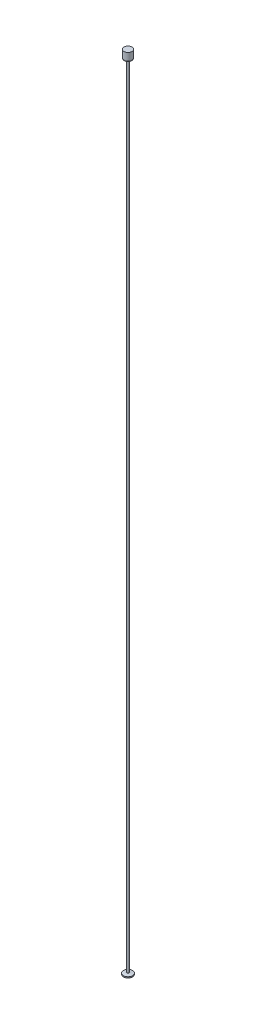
ISO-10303-21;
HEADER;
FILE_DESCRIPTION(('STEP AP214'),'2;1');
FILE_NAME('part.step','',(''),(''),'','','');
FILE_SCHEMA(('AUTOMOTIVE_DESIGN { 1 0 10303 214 1 1 1 1 }'));
ENDSEC;
DATA;
#1=APPLICATION_CONTEXT('core data for automotive mechanical design processes');
#2=APPLICATION_PROTOCOL_DEFINITION('international standard','automotive_design',2000,#1);
#3=PRODUCT_CONTEXT('',#1,'mechanical');
#4=PRODUCT('Part','Part','',(#3));
#5=PRODUCT_RELATED_PRODUCT_CATEGORY('part','',(#4));
#6=PRODUCT_DEFINITION_FORMATION('','',#4);
#7=PRODUCT_DEFINITION_CONTEXT('part definition',#1,'design');
#8=PRODUCT_DEFINITION('design','',#6,#7);
#9=PRODUCT_DEFINITION_SHAPE('','',#8);
#10=(LENGTH_UNIT() NAMED_UNIT(*) SI_UNIT(.MILLI.,.METRE.));
#11=(NAMED_UNIT(*) PLANE_ANGLE_UNIT() SI_UNIT($,.RADIAN.));
#12=(NAMED_UNIT(*) SI_UNIT($,.STERADIAN.) SOLID_ANGLE_UNIT());
#13=UNCERTAINTY_MEASURE_WITH_UNIT(LENGTH_MEASURE(1.E-05),#10,'distance_accuracy_value','');
#14=(GEOMETRIC_REPRESENTATION_CONTEXT(3) GLOBAL_UNCERTAINTY_ASSIGNED_CONTEXT((#13)) GLOBAL_UNIT_ASSIGNED_CONTEXT((#10,
#11,#12)) REPRESENTATION_CONTEXT('',''));
#15=CARTESIAN_POINT('',(0.,0.,0.));
#16=DIRECTION('',(0.,0.,1.));
#17=DIRECTION('',(1.,0.,0.));
#18=AXIS2_PLACEMENT_3D('',#15,#16,#17);
#19=CARTESIAN_POINT('',(0.,1214.5,0.));
#20=DIRECTION('',(0.,-1.,0.));
#21=DIRECTION('',(0.,0.,-1.));
#22=AXIS2_PLACEMENT_3D('',#19,#20,#21);
#23=CYLINDRICAL_SURFACE('',#22,6.);
#24=CARTESIAN_POINT('',(0.,1203.5,0.));
#25=DIRECTION('',(0.,1.,0.));
#26=DIRECTION('',(0.,0.,1.));
#27=AXIS2_PLACEMENT_3D('',#24,#25,#26);
#28=CIRCLE('',#27,6.);
#29=CARTESIAN_POINT('',(0.,1203.5,-6.));
#30=VERTEX_POINT('',#29);
#31=EDGE_CURVE('E52',#30,#30,#28,.T.);
#32=CARTESIAN_POINT('',(0.,1214.5,0.));
#33=DIRECTION('',(0.,1.,0.));
#34=DIRECTION('',(0.,0.,1.));
#35=AXIS2_PLACEMENT_3D('',#32,#33,#34);
#36=CIRCLE('',#35,6.);
#37=CARTESIAN_POINT('',(0.,1214.5,-6.));
#38=VERTEX_POINT('',#37);
#39=EDGE_CURVE('E56',#38,#38,#36,.T.);
#40=CARTESIAN_POINT('',(0.,1203.5,-6.));
#41=CARTESIAN_POINT('',(0.,1203.61458333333,-6.));
#42=CARTESIAN_POINT('',(0.,1203.72916666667,-6.));
#43=CARTESIAN_POINT('',(0.,1203.95833333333,-6.));
#44=CARTESIAN_POINT('',(0.,1204.07291666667,-6.));
#45=CARTESIAN_POINT('',(0.,1204.30208333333,-6.));
#46=CARTESIAN_POINT('',(0.,1204.41666666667,-6.));
#47=CARTESIAN_POINT('',(0.,1204.64583333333,-6.));
#48=CARTESIAN_POINT('',(0.,1204.76041666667,-6.));
#49=CARTESIAN_POINT('',(0.,1204.98958333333,-6.));
#50=CARTESIAN_POINT('',(0.,1205.10416666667,-6.));
#51=CARTESIAN_POINT('',(0.,1205.33333333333,-6.));
#52=CARTESIAN_POINT('',(0.,1205.44791666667,-6.));
#53=CARTESIAN_POINT('',(0.,1205.67708333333,-6.));
#54=CARTESIAN_POINT('',(0.,1205.79166666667,-6.));
#55=CARTESIAN_POINT('',(0.,1206.02083333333,-6.));
#56=CARTESIAN_POINT('',(0.,1206.13541666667,-6.));
#57=CARTESIAN_POINT('',(0.,1206.36458333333,-6.));
#58=CARTESIAN_POINT('',(0.,1206.47916666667,-6.));
#59=CARTESIAN_POINT('',(0.,1206.70833333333,-6.));
#60=CARTESIAN_POINT('',(0.,1206.82291666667,-6.));
#61=CARTESIAN_POINT('',(0.,1207.05208333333,-6.));
#62=CARTESIAN_POINT('',(0.,1207.16666666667,-6.));
#63=CARTESIAN_POINT('',(0.,1207.39583333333,-6.));
#64=CARTESIAN_POINT('',(0.,1207.51041666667,-6.));
#65=CARTESIAN_POINT('',(0.,1207.73958333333,-6.));
#66=CARTESIAN_POINT('',(0.,1207.85416666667,-6.));
#67=CARTESIAN_POINT('',(0.,1208.08333333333,-6.));
#68=CARTESIAN_POINT('',(0.,1208.19791666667,-6.));
#69=CARTESIAN_POINT('',(0.,1208.42708333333,-6.));
#70=CARTESIAN_POINT('',(0.,1208.54166666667,-6.));
#71=CARTESIAN_POINT('',(0.,1208.77083333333,-6.));
#72=CARTESIAN_POINT('',(0.,1208.88541666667,-6.));
#73=CARTESIAN_POINT('',(0.,1209.11458333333,-6.));
#74=CARTESIAN_POINT('',(0.,1209.22916666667,-6.));
#75=CARTESIAN_POINT('',(0.,1209.45833333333,-6.));
#76=CARTESIAN_POINT('',(0.,1209.57291666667,-6.));
#77=CARTESIAN_POINT('',(0.,1209.80208333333,-6.));
#78=CARTESIAN_POINT('',(0.,1209.91666666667,-6.));
#79=CARTESIAN_POINT('',(0.,1210.14583333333,-6.));
#80=CARTESIAN_POINT('',(0.,1210.26041666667,-6.));
#81=CARTESIAN_POINT('',(0.,1210.48958333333,-6.));
#82=CARTESIAN_POINT('',(0.,1210.60416666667,-6.));
#83=CARTESIAN_POINT('',(0.,1210.83333333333,-6.));
#84=CARTESIAN_POINT('',(0.,1210.94791666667,-6.));
#85=CARTESIAN_POINT('',(0.,1211.17708333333,-6.));
#86=CARTESIAN_POINT('',(0.,1211.29166666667,-6.));
#87=CARTESIAN_POINT('',(0.,1211.52083333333,-6.));
#88=CARTESIAN_POINT('',(0.,1211.63541666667,-6.));
#89=CARTESIAN_POINT('',(0.,1211.86458333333,-6.));
#90=CARTESIAN_POINT('',(0.,1211.97916666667,-6.));
#91=CARTESIAN_POINT('',(0.,1212.20833333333,-6.));
#92=CARTESIAN_POINT('',(0.,1212.32291666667,-6.));
#93=CARTESIAN_POINT('',(0.,1212.55208333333,-6.));
#94=CARTESIAN_POINT('',(0.,1212.66666666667,-6.));
#95=CARTESIAN_POINT('',(0.,1212.89583333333,-6.));
#96=CARTESIAN_POINT('',(0.,1213.01041666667,-6.));
#97=CARTESIAN_POINT('',(0.,1213.23958333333,-6.));
#98=CARTESIAN_POINT('',(0.,1213.35416666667,-6.));
#99=CARTESIAN_POINT('',(0.,1213.58333333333,-6.));
#100=CARTESIAN_POINT('',(0.,1213.69791666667,-6.));
#101=CARTESIAN_POINT('',(0.,1213.92708333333,-6.));
#102=CARTESIAN_POINT('',(0.,1214.04166666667,-6.));
#103=CARTESIAN_POINT('',(0.,1214.27083333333,-6.));
#104=CARTESIAN_POINT('',(0.,1214.38541666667,-6.));
#105=CARTESIAN_POINT('',(0.,1214.5,-6.));
#106=B_SPLINE_CURVE_WITH_KNOTS('',3,(#40,#41,#42,#43,#44,#45,#46,#47,#48,#49,#50,#51,#52,#53,
#54,#55,#56,#57,#58,#59,#60,#61,#62,#63,#64,#65,#66,#67,#68,#69,#70,#71,#72,#73,#74,#75,#76,#77,
#78,#79,#80,#81,#82,#83,#84,#85,#86,#87,#88,#89,#90,#91,#92,#93,#94,#95,#96,#97,#98,#99,#100,
#101,#102,#103,#104,#105),.UNSPECIFIED.,.F.,.F.,(4,2,2,2,2,2,2,2,2,2,2,2,2,2,2,2,2,2,2,2,2,2,2,
2,2,2,2,2,2,2,2,2,4),(0.,0.343750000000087,0.687500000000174,1.03125000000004,1.37500000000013,
1.71874999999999,2.06250000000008,2.40625000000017,2.75000000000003,3.09375000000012,
3.43749999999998,3.78125000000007,4.12500000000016,4.46875000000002,4.81250000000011,
5.15624999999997,5.50000000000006,5.84375000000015,6.18750000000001,6.5312500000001,
6.87499999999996,7.21875000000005,7.56250000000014,7.90625,8.25000000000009,8.59374999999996,
8.93750000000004,9.28125000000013,9.62499999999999,9.96875000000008,10.3124999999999,10.65625,
11.0000000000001),.UNSPECIFIED.);
#107=EDGE_CURVE('BSEAM45',#30,#38,#106,.T.);
#108=ORIENTED_EDGE('',*,*,#31,.T.);
#109=ORIENTED_EDGE('',*,*,#39,.F.);
#110=ORIENTED_EDGE('',*,*,#107,.T.);
#111=ORIENTED_EDGE('',*,*,#107,.F.);
#112=EDGE_LOOP('',(#108,#110,#109,#111));
#113=FACE_BOUND('',#112,.T.);
#114=ADVANCED_FACE('F45',(#113),#23,.T.);
#115=CARTESIAN_POINT('',(0.,1214.5,0.));
#116=DIRECTION('',(0.,1.,0.));
#117=DIRECTION('',(0.,0.,1.));
#118=AXIS2_PLACEMENT_3D('',#115,#116,#117);
#119=PLANE('',#118);
#120=ORIENTED_EDGE('',*,*,#39,.T.);
#121=EDGE_LOOP('',(#120));
#122=FACE_BOUND('',#121,.T.);
#123=ADVANCED_FACE('F63',(#122),#119,.T.);
#124=CARTESIAN_POINT('',(0.,1201.5,0.));
#125=DIRECTION('',(0.,1.,0.));
#126=DIRECTION('',(0.,0.,1.));
#127=AXIS2_PLACEMENT_3D('',#124,#125,#126);
#128=PLANE('',#127);
#129=CARTESIAN_POINT('',(0.,1201.5,0.));
#130=DIRECTION('',(0.,1.,0.));
#131=DIRECTION('',(0.,0.,1.));
#132=AXIS2_PLACEMENT_3D('',#129,#130,#131);
#133=CIRCLE('',#132,4.);
#134=CARTESIAN_POINT('',(0.,1201.5,4.));
#135=VERTEX_POINT('',#134);
#136=EDGE_CURVE('E11',#135,#135,#133,.F.);
#137=ORIENTED_EDGE('',*,*,#136,.T.);
#138=EDGE_LOOP('',(#137));
#139=FACE_BOUND('',#138,.T.);
#140=ADVANCED_FACE('F69',(#139),#128,.F.);
#141=CARTESIAN_POINT('',(0.,1203.5,0.));
#142=DIRECTION('',(0.,1.,0.));
#143=DIRECTION('',(0.,0.,1.));
#144=AXIS2_PLACEMENT_3D('',#141,#142,#143);
#145=TOROIDAL_SURFACE('',#144,4.,2.);
#146=ORIENTED_EDGE('',*,*,#136,.F.);
#147=EDGE_LOOP('',(#146));
#148=FACE_BOUND('',#147,.T.);
#149=ORIENTED_EDGE('',*,*,#31,.F.);
#150=EDGE_LOOP('',(#149));
#151=FACE_BOUND('',#150,.T.);
#152=ADVANCED_FACE('F47',(#148,#151),#145,.T.);
#153=CLOSED_SHELL('',(#114,#123,#140,#152));
#154=MANIFOLD_SOLID_BREP('B2',#153);
#155=CARTESIAN_POINT('',(0.,2.5,0.));
#156=DIRECTION('',(0.,-1.,0.));
#157=DIRECTION('',(0.,0.,-1.));
#158=AXIS2_PLACEMENT_3D('',#155,#156,#157);
#159=CYLINDRICAL_SURFACE('',#158,6.9);
#160=CARTESIAN_POINT('',(0.,1.61836509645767,0.));
#161=DIRECTION('',(0.,1.,0.));
#162=DIRECTION('',(0.,0.,1.));
#163=AXIS2_PLACEMENT_3D('',#160,#161,#162);
#164=CIRCLE('',#163,6.9);
#165=CARTESIAN_POINT('',(0.,1.61836509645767,-6.9));
#166=VERTEX_POINT('',#165);
#167=EDGE_CURVE('E105',#166,#166,#164,.F.);
#168=ORIENTED_EDGE('',*,*,#167,.T.);
#169=EDGE_LOOP('',(#168));
#170=FACE_BOUND('',#169,.T.);
#171=CARTESIAN_POINT('',(0.,0.,0.));
#172=DIRECTION('',(0.,1.,0.));
#173=DIRECTION('',(0.,0.,1.));
#174=AXIS2_PLACEMENT_3D('',#171,#172,#173);
#175=CIRCLE('',#174,6.9);
#176=CARTESIAN_POINT('',(0.,0.,6.9));
#177=VERTEX_POINT('',#176);
#178=EDGE_CURVE('E117',#177,#177,#175,.T.);
#179=ORIENTED_EDGE('',*,*,#178,.T.);
#180=EDGE_LOOP('',(#179));
#181=FACE_BOUND('',#180,.T.);
#182=ADVANCED_FACE('F100',(#170,#181),#159,.T.);
#183=CARTESIAN_POINT('',(0.,2.5,0.));
#184=DIRECTION('',(0.,1.,0.));
#185=DIRECTION('',(0.,0.,1.));
#186=AXIS2_PLACEMENT_3D('',#183,#184,#185);
#187=PLANE('',#186);
#188=CARTESIAN_POINT('',(0.,2.5,0.));
#189=DIRECTION('',(0.,1.,0.));
#190=DIRECTION('',(0.,0.,1.));
#191=AXIS2_PLACEMENT_3D('',#188,#189,#190);
#192=CIRCLE('',#191,1.5);
#193=CARTESIAN_POINT('',(0.,2.5,1.5));
#194=VERTEX_POINT('',#193);
#195=EDGE_CURVE('E44',#194,#194,#192,.T.);
#196=ORIENTED_EDGE('',*,*,#195,.F.);
#197=EDGE_LOOP('',(#196));
#198=FACE_BOUND('',#197,.T.);
#199=CARTESIAN_POINT('',(0.,2.5,0.));
#200=DIRECTION('',(0.,1.,0.));
#201=DIRECTION('',(0.,0.,1.));
#202=AXIS2_PLACEMENT_3D('',#199,#200,#201);
#203=CIRCLE('',#202,1.8999999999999);
#204=CARTESIAN_POINT('',(0.,2.5,-1.8999999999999));
#205=VERTEX_POINT('',#204);
#206=EDGE_CURVE('E113',#205,#205,#203,.T.);
#207=ORIENTED_EDGE('',*,*,#206,.T.);
#208=EDGE_LOOP('',(#207));
#209=FACE_BOUND('',#208,.T.);
#210=ADVANCED_FACE('F122',(#198,#209),#187,.T.);
#211=CARTESIAN_POINT('',(0.,0.,0.));
#212=DIRECTION('',(0.,1.,0.));
#213=DIRECTION('',(0.,0.,1.));
#214=AXIS2_PLACEMENT_3D('',#211,#212,#213);
#215=PLANE('',#214);
#216=ORIENTED_EDGE('',*,*,#178,.F.);
#217=EDGE_LOOP('',(#216));
#218=FACE_BOUND('',#217,.T.);
#219=ADVANCED_FACE('F126',(#218),#215,.F.);
#220=CARTESIAN_POINT('',(0.,2.5,0.));
#221=DIRECTION('',(0.,-1.,0.));
#222=DIRECTION('',(0.,0.,-1.));
#223=AXIS2_PLACEMENT_3D('',#220,#221,#222);
#224=CONICAL_SURFACE('',#223,1.8999999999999,1.39626340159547);
#225=CARTESIAN_POINT('',(0.,1.61836509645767,-6.9));
#226=CARTESIAN_POINT('',(0.,1.62754879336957,-6.84791666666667));
#227=CARTESIAN_POINT('',(0.,1.63673249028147,-6.79583333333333));
#228=CARTESIAN_POINT('',(0.,1.65509988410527,-6.69166666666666));
#229=CARTESIAN_POINT('',(0.,1.66428358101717,-6.63958333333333));
#230=CARTESIAN_POINT('',(0.,1.68265097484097,-6.53541666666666));
#231=CARTESIAN_POINT('',(0.,1.69183467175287,-6.48333333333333));
#232=CARTESIAN_POINT('',(0.,1.71020206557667,-6.37916666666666));
#233=CARTESIAN_POINT('',(0.,1.71938576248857,-6.32708333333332));
#234=CARTESIAN_POINT('',(0.,1.73775315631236,-6.22291666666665));
#235=CARTESIAN_POINT('',(0.,1.74693685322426,-6.17083333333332));
#236=CARTESIAN_POINT('',(0.,1.76530424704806,-6.06666666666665));
#237=CARTESIAN_POINT('',(0.,1.77448794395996,-6.01458333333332));
#238=CARTESIAN_POINT('',(0.,1.79285533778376,-5.91041666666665));
#239=CARTESIAN_POINT('',(0.,1.80203903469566,-5.85833333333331));
#240=CARTESIAN_POINT('',(0.,1.82040642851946,-5.75416666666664));
#241=CARTESIAN_POINT('',(0.,1.82959012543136,-5.70208333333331));
#242=CARTESIAN_POINT('',(0.,1.84795751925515,-5.59791666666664));
#243=CARTESIAN_POINT('',(0.,1.85714121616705,-5.54583333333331));
#244=CARTESIAN_POINT('',(0.,1.87550860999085,-5.44166666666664));
#245=CARTESIAN_POINT('',(0.,1.88469230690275,-5.3895833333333));
#246=CARTESIAN_POINT('',(0.,1.90305970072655,-5.28541666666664));
#247=CARTESIAN_POINT('',(0.,1.91224339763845,-5.2333333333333));
#248=CARTESIAN_POINT('',(0.,1.93061079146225,-5.12916666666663));
#249=CARTESIAN_POINT('',(0.,1.93979448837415,-5.0770833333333));
#250=CARTESIAN_POINT('',(0.,1.95816188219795,-4.97291666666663));
#251=CARTESIAN_POINT('',(0.,1.96734557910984,-4.9208333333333));
#252=CARTESIAN_POINT('',(0.,1.98571297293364,-4.81666666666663));
#253=CARTESIAN_POINT('',(0.,1.99489666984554,-4.76458333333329));
#254=CARTESIAN_POINT('',(0.,2.01326406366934,-4.66041666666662));
#255=CARTESIAN_POINT('',(0.,2.02244776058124,-4.60833333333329));
#256=CARTESIAN_POINT('',(0.,2.04081515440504,-4.50416666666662));
#257=CARTESIAN_POINT('',(0.,2.04999885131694,-4.45208333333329));
#258=CARTESIAN_POINT('',(0.,2.06836624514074,-4.34791666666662));
#259=CARTESIAN_POINT('',(0.,2.07754994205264,-4.29583333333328));
#260=CARTESIAN_POINT('',(0.,2.09591733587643,-4.19166666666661));
#261=CARTESIAN_POINT('',(0.,2.10510103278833,-4.13958333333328));
#262=CARTESIAN_POINT('',(0.,2.12346842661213,-4.03541666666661));
#263=CARTESIAN_POINT('',(0.,2.13265212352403,-3.98333333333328));
#264=CARTESIAN_POINT('',(0.,2.15101951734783,-3.87916666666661));
#265=CARTESIAN_POINT('',(0.,2.16020321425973,-3.82708333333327));
#266=CARTESIAN_POINT('',(0.,2.17857060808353,-3.72291666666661));
#267=CARTESIAN_POINT('',(0.,2.18775430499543,-3.67083333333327));
#268=CARTESIAN_POINT('',(0.,2.20612169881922,-3.5666666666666));
#269=CARTESIAN_POINT('',(0.,2.21530539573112,-3.51458333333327));
#270=CARTESIAN_POINT('',(0.,2.23367278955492,-3.4104166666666));
#271=CARTESIAN_POINT('',(0.,2.24285648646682,-3.35833333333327));
#272=CARTESIAN_POINT('',(0.,2.26122388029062,-3.2541666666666));
#273=CARTESIAN_POINT('',(0.,2.27040757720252,-3.20208333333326));
#274=CARTESIAN_POINT('',(0.,2.28877497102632,-3.09791666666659));
#275=CARTESIAN_POINT('',(0.,2.29795866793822,-3.04583333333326));
#276=CARTESIAN_POINT('',(0.,2.31632606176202,-2.94166666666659));
#277=CARTESIAN_POINT('',(0.,2.32550975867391,-2.88958333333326));
#278=CARTESIAN_POINT('',(0.,2.34387715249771,-2.78541666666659));
#279=CARTESIAN_POINT('',(0.,2.35306084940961,-2.73333333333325));
#280=CARTESIAN_POINT('',(0.,2.37142824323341,-2.62916666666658));
#281=CARTESIAN_POINT('',(0.,2.38061194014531,-2.57708333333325));
#282=CARTESIAN_POINT('',(0.,2.39897933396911,-2.47291666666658));
#283=CARTESIAN_POINT('',(0.,2.40816303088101,-2.42083333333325));
#284=CARTESIAN_POINT('',(0.,2.42653042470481,-2.31666666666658));
#285=CARTESIAN_POINT('',(0.,2.43571412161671,-2.26458333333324));
#286=CARTESIAN_POINT('',(0.,2.4540815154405,-2.16041666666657));
#287=CARTESIAN_POINT('',(0.,2.4632652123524,-2.10833333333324));
#288=CARTESIAN_POINT('',(0.,2.4816326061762,-2.00416666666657));
#289=CARTESIAN_POINT('',(0.,2.4908163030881,-1.95208333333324));
#290=CARTESIAN_POINT('',(0.,2.5,-1.8999999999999));
#291=B_SPLINE_CURVE_WITH_KNOTS('',3,(#225,#226,#227,#228,#229,#230,#231,#232,#233,#234,#235,
#236,#237,#238,#239,#240,#241,#242,#243,#244,#245,#246,#247,#248,#249,#250,#251,#252,#253,#254,
#255,#256,#257,#258,#259,#260,#261,#262,#263,#264,#265,#266,#267,#268,#269,#270,#271,#272,#273,
#274,#275,#276,#277,#278,#279,#280,#281,#282,#283,#284,#285,#286,#287,#288,#289,#290),
.UNSPECIFIED.,.F.,.F.,(4,2,2,2,2,2,2,2,2,2,2,2,2,2,2,2,2,2,2,2,2,2,2,2,2,2,2,2,2,2,2,2,4),(0.,
0.158660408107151,0.317320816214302,0.475981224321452,0.634641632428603,0.793302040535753,
0.951962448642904,1.11062285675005,1.26928326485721,1.42794367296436,1.58660408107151,
1.74526448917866,1.90392489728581,2.06258530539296,2.22124571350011,2.37990612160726,
2.53856652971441,2.69722693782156,2.85588734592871,3.01454775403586,3.17320816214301,
3.33186857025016,3.49052897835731,3.64918938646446,3.80784979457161,3.96651020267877,
4.12517061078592,4.28383101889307,4.44249142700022,4.60115183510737,4.75981224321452,
4.91847265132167,5.07713305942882),.UNSPECIFIED.);
#292=EDGE_CURVE('BSEAM103',#166,#205,#291,.T.);
#293=ORIENTED_EDGE('',*,*,#167,.F.);
#294=ORIENTED_EDGE('',*,*,#206,.F.);
#295=ORIENTED_EDGE('',*,*,#292,.T.);
#296=ORIENTED_EDGE('',*,*,#292,.F.);
#297=EDGE_LOOP('',(#293,#295,#294,#296));
#298=FACE_BOUND('',#297,.T.);
#299=ADVANCED_FACE('F103',(#298),#224,.T.);
#300=CARTESIAN_POINT('',(0.,1202.5,0.));
#301=DIRECTION('',(0.,-1.,0.));
#302=DIRECTION('',(0.,0.,-1.));
#303=AXIS2_PLACEMENT_3D('',#300,#301,#302);
#304=CYLINDRICAL_SURFACE('',#303,1.5);
#305=CARTESIAN_POINT('',(0.,1202.5,0.));
#306=DIRECTION('',(0.,1.,0.));
#307=DIRECTION('',(0.,0.,1.));
#308=AXIS2_PLACEMENT_3D('',#305,#306,#307);
#309=CIRCLE('',#308,1.5);
#310=CARTESIAN_POINT('',(0.,1202.5,1.5));
#311=VERTEX_POINT('',#310);
#312=EDGE_CURVE('E116',#311,#311,#309,.T.);
#313=ORIENTED_EDGE('',*,*,#312,.F.);
#314=EDGE_LOOP('',(#313));
#315=FACE_BOUND('',#314,.T.);
#316=ORIENTED_EDGE('',*,*,#195,.T.);
#317=EDGE_LOOP('',(#316));
#318=FACE_BOUND('',#317,.T.);
#319=ADVANCED_FACE('F125',(#315,#318),#304,.T.);
#320=CARTESIAN_POINT('',(0.,1202.5,0.));
#321=DIRECTION('',(0.,1.,0.));
#322=DIRECTION('',(0.,0.,1.));
#323=AXIS2_PLACEMENT_3D('',#320,#321,#322);
#324=PLANE('',#323);
#325=ORIENTED_EDGE('',*,*,#312,.T.);
#326=EDGE_LOOP('',(#325));
#327=FACE_BOUND('',#326,.T.);
#328=ADVANCED_FACE('F132',(#327),#324,.T.);
#329=CLOSED_SHELL('',(#182,#210,#219,#299,#319,#328));
#330=MANIFOLD_SOLID_BREP('B6',#329);
#331=ADVANCED_BREP_SHAPE_REPRESENTATION('',(#18,#154,#330),#14);
#332=SHAPE_DEFINITION_REPRESENTATION(#9,#331);
ENDSEC;
END-ISO-10303-21;
